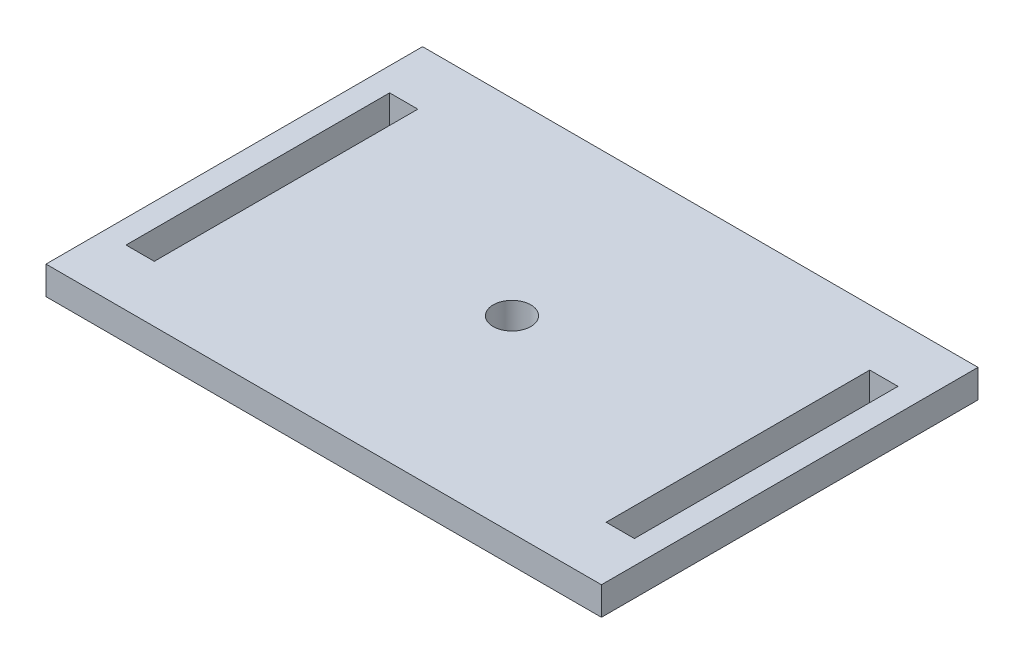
from build123d import *

# Parameters (mm, degrees)
SKETCH1_W           = 59
SKETCH1_H           = 40
SKETCH1_R           = 2
BOSS_EXTRUDE1_DEPTH = 3
SKETCH2_W           = 3
SKETCH2_H           = 28
CUT_EXTRUDE1_DEPTH  = 3


with BuildPart() as part:
    # Sketch1 → Boss-Extrude1 (new body)
    with BuildSketch(Plane(origin=(0, 0, 0), x_dir=(1, 0, 0), z_dir=(0, 1, 0))):
        Rectangle(SKETCH1_W, SKETCH1_H)
        with Locations(Location((0, 0, 0), (0, 0, 270))):
            Circle(SKETCH1_R, mode=Mode.SUBTRACT)
    extrude(amount=BOSS_EXTRUDE1_DEPTH)

    # Sketch2 → Cut-Extrude1 (cut)
    with BuildSketch(Plane(origin=(0, 0, 0), x_dir=(1, 0, 0), z_dir=(0, 1, 0))):
        with Locations((-25.5, 0)):
            Rectangle(SKETCH2_W, SKETCH2_H)
        with Locations((25.5, 0)):
            Rectangle(SKETCH2_W, SKETCH2_H)
    extrude(amount=CUT_EXTRUDE1_DEPTH, mode=Mode.SUBTRACT)


solid = part.part
